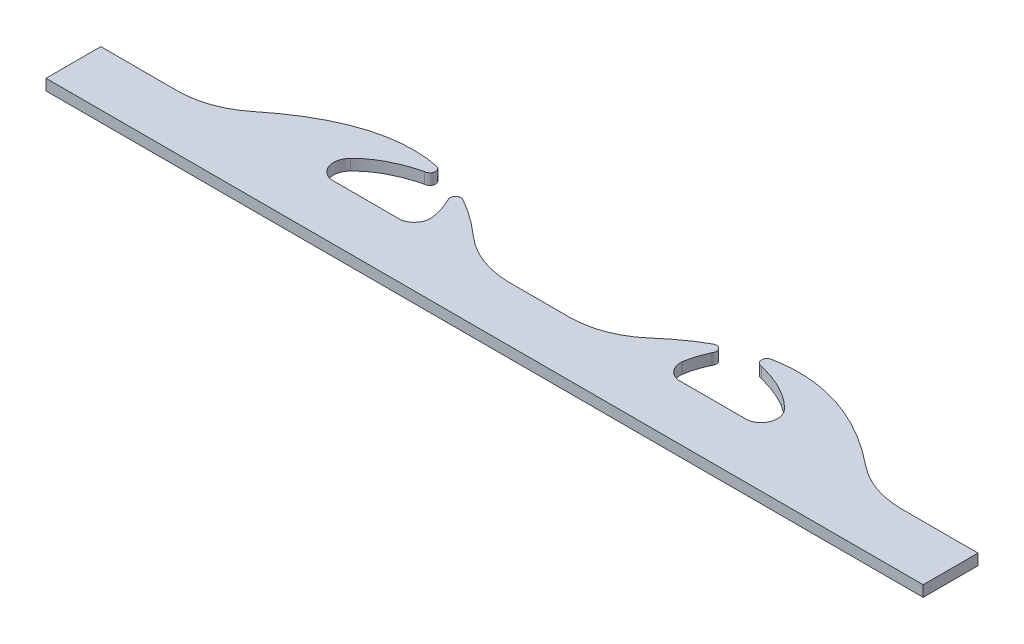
ISO-10303-21;
HEADER;
FILE_DESCRIPTION(('STEP AP214'),'2;1');
FILE_NAME('part.step','',(''),(''),'','','');
FILE_SCHEMA(('AUTOMOTIVE_DESIGN { 1 0 10303 214 1 1 1 1 }'));
ENDSEC;
DATA;
#1=APPLICATION_CONTEXT('core data for automotive mechanical design processes');
#2=APPLICATION_PROTOCOL_DEFINITION('international standard','automotive_design',2000,#1);
#3=PRODUCT_CONTEXT('',#1,'mechanical');
#4=PRODUCT('Part','Part','',(#3));
#5=PRODUCT_RELATED_PRODUCT_CATEGORY('part','',(#4));
#6=PRODUCT_DEFINITION_FORMATION('','',#4);
#7=PRODUCT_DEFINITION_CONTEXT('part definition',#1,'design');
#8=PRODUCT_DEFINITION('design','',#6,#7);
#9=PRODUCT_DEFINITION_SHAPE('','',#8);
#10=(LENGTH_UNIT() NAMED_UNIT(*) SI_UNIT(.MILLI.,.METRE.));
#11=(NAMED_UNIT(*) PLANE_ANGLE_UNIT() SI_UNIT($,.RADIAN.));
#12=(NAMED_UNIT(*) SI_UNIT($,.STERADIAN.) SOLID_ANGLE_UNIT());
#13=UNCERTAINTY_MEASURE_WITH_UNIT(LENGTH_MEASURE(1.E-05),#10,'distance_accuracy_value','');
#14=(GEOMETRIC_REPRESENTATION_CONTEXT(3) GLOBAL_UNCERTAINTY_ASSIGNED_CONTEXT((#13)) GLOBAL_UNIT_ASSIGNED_CONTEXT((#10,
#11,#12)) REPRESENTATION_CONTEXT('',''));
#15=CARTESIAN_POINT('',(0.,0.,0.));
#16=DIRECTION('',(0.,0.,1.));
#17=DIRECTION('',(1.,0.,0.));
#18=AXIS2_PLACEMENT_3D('',#15,#16,#17);
#19=CARTESIAN_POINT('',(33.011381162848,1.,-13.));
#20=DIRECTION('',(0.,-1.,0.));
#21=DIRECTION('',(0.,0.,-1.));
#22=AXIS2_PLACEMENT_3D('',#19,#20,#21);
#23=CYLINDRICAL_SURFACE('',#22,8.);
#24=CARTESIAN_POINT('',(33.011381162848,0.,-13.));
#25=DIRECTION('',(0.,-1.,0.));
#26=DIRECTION('',(0.,0.,-1.));
#27=AXIS2_PLACEMENT_3D('',#24,#25,#26);
#28=CIRCLE('',#27,8.);
#29=CARTESIAN_POINT('',(33.011381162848,0.,-5.));
#30=VERTEX_POINT('',#29);
#31=CARTESIAN_POINT('',(27.9776129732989,0.,-6.78218866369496));
#32=VERTEX_POINT('',#31);
#33=EDGE_CURVE('E249',#30,#32,#28,.T.);
#34=ORIENTED_EDGE('',*,*,#33,.T.);
#35=DIRECTION('',(0.,-1.,0.));
#36=VECTOR('',#35,1.);
#37=CARTESIAN_POINT('',(27.9776129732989,1.,-6.78218866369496));
#38=LINE('',#37,#36);
#39=CARTESIAN_POINT('',(27.9776129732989,1.,-6.78218866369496));
#40=VERTEX_POINT('',#39);
#41=EDGE_CURVE('E11',#40,#32,#38,.T.);
#42=ORIENTED_EDGE('',*,*,#41,.F.);
#43=CARTESIAN_POINT('',(33.011381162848,1.,-13.));
#44=DIRECTION('',(0.,-1.,0.));
#45=DIRECTION('',(0.,0.,-1.));
#46=AXIS2_PLACEMENT_3D('',#43,#44,#45);
#47=CIRCLE('',#46,8.);
#48=CARTESIAN_POINT('',(33.011381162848,1.,-5.));
#49=VERTEX_POINT('',#48);
#50=EDGE_CURVE('E343',#49,#40,#47,.T.);
#51=ORIENTED_EDGE('',*,*,#50,.F.);
#52=DIRECTION('',(0.,-1.,0.));
#53=VECTOR('',#52,1.);
#54=CARTESIAN_POINT('',(33.011381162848,1.,-5.));
#55=LINE('',#54,#53);
#56=EDGE_CURVE('E245',#49,#30,#55,.T.);
#57=ORIENTED_EDGE('',*,*,#56,.T.);
#58=EDGE_LOOP('',(#34,#42,#51,#57));
#59=FACE_BOUND('',#58,.T.);
#60=ADVANCED_FACE('F33',(#59),#23,.F.);
#61=CARTESIAN_POINT('',(27.9776129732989,1.,-6.78218866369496));
#62=CARTESIAN_POINT('',(23.8539215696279,1.,-10.120615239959));
#63=CARTESIAN_POINT('',(19.5835212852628,1.,-11.6243992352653));
#64=CARTESIAN_POINT('',(15.4631654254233,1.,-10.9173485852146));
#65=CARTESIAN_POINT('',(15.1957010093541,1.,-10.8619827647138));
#66=B_SPLINE_CURVE_WITH_KNOTS('',3,(#61,#62,#63,#64,#65),.UNSPECIFIED.,.F.,.F.,(4,1,4),
(0.0792264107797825,0.566366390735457,0.600269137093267),.UNSPECIFIED.);
#67=DIRECTION('',(0.,-1.,0.));
#68=VECTOR('',#67,1.);
#69=SURFACE_OF_LINEAR_EXTRUSION('',#66,#68);
#70=CARTESIAN_POINT('',(27.9776129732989,0.,-6.78218866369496));
#71=CARTESIAN_POINT('',(23.8539215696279,0.,-10.120615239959));
#72=CARTESIAN_POINT('',(19.5835212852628,0.,-11.6243992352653));
#73=CARTESIAN_POINT('',(15.4631654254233,0.,-10.9173485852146));
#74=CARTESIAN_POINT('',(15.1957010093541,0.,-10.8619827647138));
#75=B_SPLINE_CURVE_WITH_KNOTS('',3,(#70,#71,#72,#73,#74),.UNSPECIFIED.,.F.,.F.,(4,1,4),
(0.0792264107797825,0.566366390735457,0.600269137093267),.UNSPECIFIED.);
#76=CARTESIAN_POINT('',(15.1957010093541,0.,-10.8619827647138));
#77=VERTEX_POINT('',#76);
#78=EDGE_CURVE('E252',#32,#77,#75,.T.);
#79=ORIENTED_EDGE('',*,*,#78,.T.);
#80=DIRECTION('',(0.,-1.,0.));
#81=VECTOR('',#80,1.);
#82=CARTESIAN_POINT('',(15.1957010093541,1.,-10.8619827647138));
#83=LINE('',#82,#81);
#84=CARTESIAN_POINT('',(15.1957010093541,1.,-10.8619827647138));
#85=VERTEX_POINT('',#84);
#86=EDGE_CURVE('E41',#85,#77,#83,.T.);
#87=ORIENTED_EDGE('',*,*,#86,.F.);
#88=EDGE_CURVE('E152',#40,#85,#66,.T.);
#89=ORIENTED_EDGE('',*,*,#88,.F.);
#90=ORIENTED_EDGE('',*,*,#41,.T.);
#91=EDGE_LOOP('',(#79,#87,#89,#90));
#92=FACE_BOUND('',#91,.T.);
#93=ADVANCED_FACE('F478',(#92),#69,.F.);
#94=CARTESIAN_POINT('',(15.3715812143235,1.,-10.3939377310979));
#95=DIRECTION('',(0.,-1.,0.));
#96=DIRECTION('',(0.,0.,-1.));
#97=AXIS2_PLACEMENT_3D('',#94,#95,#96);
#98=CYLINDRICAL_SURFACE('',#97,0.499999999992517);
#99=CARTESIAN_POINT('',(15.3715812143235,0.,-10.3939377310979));
#100=DIRECTION('',(0.,1.,0.));
#101=DIRECTION('',(0.,0.,1.));
#102=AXIS2_PLACEMENT_3D('',#99,#100,#101);
#103=CIRCLE('',#102,0.499999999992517);
#104=CARTESIAN_POINT('',(15.3715812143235,0.,-9.89393773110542));
#105=VERTEX_POINT('',#104);
#106=EDGE_CURVE('E256',#77,#105,#103,.T.);
#107=ORIENTED_EDGE('',*,*,#106,.T.);
#108=DIRECTION('',(0.,-1.,0.));
#109=VECTOR('',#108,1.);
#110=CARTESIAN_POINT('',(15.3715812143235,1.,-9.89393773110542));
#111=LINE('',#110,#109);
#112=CARTESIAN_POINT('',(15.3715812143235,1.,-9.89393773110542));
#113=VERTEX_POINT('',#112);
#114=EDGE_CURVE('E410',#113,#105,#111,.T.);
#115=ORIENTED_EDGE('',*,*,#114,.F.);
#116=CARTESIAN_POINT('',(15.3715812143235,1.,-10.3939377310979));
#117=DIRECTION('',(0.,1.,0.));
#118=DIRECTION('',(0.,0.,1.));
#119=AXIS2_PLACEMENT_3D('',#116,#117,#118);
#120=CIRCLE('',#119,0.499999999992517);
#121=EDGE_CURVE('E418',#85,#113,#120,.T.);
#122=ORIENTED_EDGE('',*,*,#121,.F.);
#123=ORIENTED_EDGE('',*,*,#86,.T.);
#124=EDGE_LOOP('',(#107,#115,#122,#123));
#125=FACE_BOUND('',#124,.T.);
#126=ADVANCED_FACE('F416',(#125),#98,.T.);
#127=CARTESIAN_POINT('',(15.3715812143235,1.,-9.89393773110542));
#128=CARTESIAN_POINT('',(18.3559813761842,1.,-9.14469898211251));
#129=CARTESIAN_POINT('',(19.5334496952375,1.,-7.80716702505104));
#130=CARTESIAN_POINT('',(19.7970427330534,1.,-7.5456796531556));
#131=B_SPLINE_CURVE_WITH_KNOTS('',3,(#127,#128,#129,#130),.UNSPECIFIED.,.F.,.F.,(4,4),(0.,1.),.UNSPECIFIED.);
#132=DIRECTION('',(0.,-1.,0.));
#133=VECTOR('',#132,1.);
#134=SURFACE_OF_LINEAR_EXTRUSION('',#131,#133);
#135=CARTESIAN_POINT('',(15.3715812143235,0.,-9.89393773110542));
#136=CARTESIAN_POINT('',(18.3559813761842,0.,-9.14469898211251));
#137=CARTESIAN_POINT('',(19.5334496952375,0.,-7.80716702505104));
#138=CARTESIAN_POINT('',(19.7970427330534,0.,-7.5456796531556));
#139=B_SPLINE_CURVE_WITH_KNOTS('',3,(#135,#136,#137,#138),.UNSPECIFIED.,.F.,.F.,(4,4),(0.,1.),.UNSPECIFIED.);
#140=CARTESIAN_POINT('',(19.7970427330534,0.,-7.5456796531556));
#141=VERTEX_POINT('',#140);
#142=EDGE_CURVE('E261',#105,#141,#139,.T.);
#143=ORIENTED_EDGE('',*,*,#142,.T.);
#144=DIRECTION('',(0.,-1.,0.));
#145=VECTOR('',#144,1.);
#146=CARTESIAN_POINT('',(19.7970427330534,1.,-7.5456796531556));
#147=LINE('',#146,#145);
#148=CARTESIAN_POINT('',(19.7970427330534,1.,-7.5456796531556));
#149=VERTEX_POINT('',#148);
#150=EDGE_CURVE('E407',#149,#141,#147,.T.);
#151=ORIENTED_EDGE('',*,*,#150,.F.);
#152=EDGE_CURVE('E436',#113,#149,#131,.T.);
#153=ORIENTED_EDGE('',*,*,#152,.F.);
#154=ORIENTED_EDGE('',*,*,#114,.T.);
#155=EDGE_LOOP('',(#143,#151,#153,#154));
#156=FACE_BOUND('',#155,.T.);
#157=ADVANCED_FACE('F427',(#156),#134,.F.);
#158=CARTESIAN_POINT('',(18.7453083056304,1.,-6.47616822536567));
#159=DIRECTION('',(0.,-1.,0.));
#160=DIRECTION('',(0.,0.,-1.));
#161=AXIS2_PLACEMENT_3D('',#158,#159,#160);
#162=CYLINDRICAL_SURFACE('',#161,1.5);
#163=CARTESIAN_POINT('',(18.7453083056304,0.,-6.47616822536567));
#164=DIRECTION('',(0.,-1.,0.));
#165=DIRECTION('',(0.,0.,1.));
#166=AXIS2_PLACEMENT_3D('',#163,#164,#165);
#167=CIRCLE('',#166,1.5);
#168=CARTESIAN_POINT('',(19.0116302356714,0.,-5.));
#169=VERTEX_POINT('',#168);
#170=EDGE_CURVE('E265',#141,#169,#167,.T.);
#171=ORIENTED_EDGE('',*,*,#170,.T.);
#172=DIRECTION('',(0.,-1.,0.));
#173=VECTOR('',#172,1.);
#174=CARTESIAN_POINT('',(19.0116302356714,1.,-5.));
#175=LINE('',#174,#173);
#176=CARTESIAN_POINT('',(19.0116302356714,1.,-5.));
#177=VERTEX_POINT('',#176);
#178=EDGE_CURVE('E404',#177,#169,#175,.T.);
#179=ORIENTED_EDGE('',*,*,#178,.F.);
#180=CARTESIAN_POINT('',(18.7453083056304,1.,-6.47616822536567));
#181=DIRECTION('',(0.,-1.,0.));
#182=DIRECTION('',(0.,0.,1.));
#183=AXIS2_PLACEMENT_3D('',#180,#181,#182);
#184=CIRCLE('',#183,1.5);
#185=EDGE_CURVE('E433',#149,#177,#184,.T.);
#186=ORIENTED_EDGE('',*,*,#185,.F.);
#187=ORIENTED_EDGE('',*,*,#150,.T.);
#188=EDGE_LOOP('',(#171,#179,#186,#187));
#189=FACE_BOUND('',#188,.T.);
#190=ADVANCED_FACE('F431',(#189),#162,.F.);
#191=CARTESIAN_POINT('',(12.6254232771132,1.,-5.));
#192=DIRECTION('',(0.,0.,1.));
#193=DIRECTION('',(1.,0.,0.));
#194=AXIS2_PLACEMENT_3D('',#191,#192,#193);
#195=PLANE('',#194);
#196=DIRECTION('',(-1.,0.,0.));
#197=VECTOR('',#196,1.);
#198=CARTESIAN_POINT('',(12.6254232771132,0.,-5.));
#199=LINE('',#198,#197);
#200=CARTESIAN_POINT('',(12.6254232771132,0.,-5.));
#201=VERTEX_POINT('',#200);
#202=EDGE_CURVE('E270',#169,#201,#199,.T.);
#203=ORIENTED_EDGE('',*,*,#202,.T.);
#204=DIRECTION('',(0.,-1.,0.));
#205=VECTOR('',#204,1.);
#206=CARTESIAN_POINT('',(12.6254232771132,1.,-5.));
#207=LINE('',#206,#205);
#208=CARTESIAN_POINT('',(12.6254232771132,1.,-5.));
#209=VERTEX_POINT('',#208);
#210=EDGE_CURVE('E401',#209,#201,#207,.T.);
#211=ORIENTED_EDGE('',*,*,#210,.F.);
#212=DIRECTION('',(-1.,0.,0.));
#213=VECTOR('',#212,1.);
#214=CARTESIAN_POINT('',(12.6254232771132,1.,-5.));
#215=LINE('',#214,#213);
#216=EDGE_CURVE('E435',#177,#209,#215,.T.);
#217=ORIENTED_EDGE('',*,*,#216,.F.);
#218=ORIENTED_EDGE('',*,*,#178,.T.);
#219=EDGE_LOOP('',(#203,#211,#217,#218));
#220=FACE_BOUND('',#219,.T.);
#221=ADVANCED_FACE('F468',(#220),#195,.F.);
#222=CARTESIAN_POINT('',(12.8917452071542,1.,-6.47616822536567));
#223=DIRECTION('',(0.,-1.,0.));
#224=DIRECTION('',(0.,0.,-1.));
#225=AXIS2_PLACEMENT_3D('',#222,#223,#224);
#226=CYLINDRICAL_SURFACE('',#225,1.5);
#227=CARTESIAN_POINT('',(12.8917452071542,0.,-6.47616822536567));
#228=DIRECTION('',(0.,-1.,0.));
#229=DIRECTION('',(0.,0.,1.));
#230=AXIS2_PLACEMENT_3D('',#227,#228,#229);
#231=CIRCLE('',#230,1.5);
#232=CARTESIAN_POINT('',(11.3978589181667,0.,-6.61145959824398));
#233=VERTEX_POINT('',#232);
#234=EDGE_CURVE('E272',#201,#233,#231,.T.);
#235=ORIENTED_EDGE('',*,*,#234,.T.);
#236=DIRECTION('',(0.,-1.,0.));
#237=VECTOR('',#236,1.);
#238=CARTESIAN_POINT('',(11.3978589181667,1.,-6.61145959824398));
#239=LINE('',#238,#237);
#240=CARTESIAN_POINT('',(11.3978589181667,1.,-6.61145959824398));
#241=VERTEX_POINT('',#240);
#242=EDGE_CURVE('E398',#241,#233,#239,.T.);
#243=ORIENTED_EDGE('',*,*,#242,.F.);
#244=CARTESIAN_POINT('',(12.8917452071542,1.,-6.47616822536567));
#245=DIRECTION('',(0.,-1.,0.));
#246=DIRECTION('',(0.,0.,1.));
#247=AXIS2_PLACEMENT_3D('',#244,#245,#246);
#248=CIRCLE('',#247,1.5);
#249=EDGE_CURVE('E438',#209,#241,#248,.T.);
#250=ORIENTED_EDGE('',*,*,#249,.F.);
#251=ORIENTED_EDGE('',*,*,#210,.T.);
#252=EDGE_LOOP('',(#235,#243,#250,#251));
#253=FACE_BOUND('',#252,.T.);
#254=ADVANCED_FACE('F463',(#253),#226,.F.);
#255=CARTESIAN_POINT('',(11.3978589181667,1.,-6.61145959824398));
#256=CARTESIAN_POINT('',(11.5099300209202,1.,-7.51159308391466));
#257=CARTESIAN_POINT('',(12.0355670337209,1.,-8.68251660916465));
#258=B_SPLINE_CURVE_WITH_KNOTS('',2,(#255,#256,#257),.UNSPECIFIED.,.F.,.F.,(3,3),(0.,1.),.UNSPECIFIED.);
#259=DIRECTION('',(0.,-1.,0.));
#260=VECTOR('',#259,1.);
#261=SURFACE_OF_LINEAR_EXTRUSION('',#258,#260);
#262=CARTESIAN_POINT('',(11.3978589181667,0.,-6.61145959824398));
#263=CARTESIAN_POINT('',(11.5099300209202,0.,-7.51159308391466));
#264=CARTESIAN_POINT('',(12.0355670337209,0.,-8.68251660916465));
#265=B_SPLINE_CURVE_WITH_KNOTS('',2,(#262,#263,#264),.UNSPECIFIED.,.F.,.F.,(3,3),(0.,1.),.UNSPECIFIED.);
#266=CARTESIAN_POINT('',(12.0355670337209,0.,-8.68251660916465));
#267=VERTEX_POINT('',#266);
#268=EDGE_CURVE('E274',#233,#267,#265,.T.);
#269=ORIENTED_EDGE('',*,*,#268,.T.);
#270=DIRECTION('',(0.,-1.,0.));
#271=VECTOR('',#270,1.);
#272=CARTESIAN_POINT('',(12.0355670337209,1.,-8.68251660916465));
#273=LINE('',#272,#271);
#274=CARTESIAN_POINT('',(12.0355670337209,1.,-8.68251660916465));
#275=VERTEX_POINT('',#274);
#276=EDGE_CURVE('E395',#275,#267,#273,.T.);
#277=ORIENTED_EDGE('',*,*,#276,.F.);
#278=EDGE_CURVE('E447',#241,#275,#258,.T.);
#279=ORIENTED_EDGE('',*,*,#278,.F.);
#280=ORIENTED_EDGE('',*,*,#242,.T.);
#281=EDGE_LOOP('',(#269,#277,#279,#280));
#282=FACE_BOUND('',#281,.T.);
#283=ADVANCED_FACE('F458',(#282),#261,.F.);
#284=CARTESIAN_POINT('',(11.6440581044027,1.,-8.99351622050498));
#285=DIRECTION('',(0.,-1.,0.));
#286=DIRECTION('',(0.,0.,-1.));
#287=AXIS2_PLACEMENT_3D('',#284,#285,#286);
#288=CYLINDRICAL_SURFACE('',#287,0.499999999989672);
#289=CARTESIAN_POINT('',(11.6440581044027,0.,-8.99351622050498));
#290=DIRECTION('',(0.,1.,0.));
#291=DIRECTION('',(0.,0.,1.));
#292=AXIS2_PLACEMENT_3D('',#289,#290,#291);
#293=CIRCLE('',#292,0.499999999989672);
#294=CARTESIAN_POINT('',(11.4660383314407,0.,-9.46075166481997));
#295=VERTEX_POINT('',#294);
#296=EDGE_CURVE('E278',#267,#295,#293,.T.);
#297=ORIENTED_EDGE('',*,*,#296,.T.);
#298=DIRECTION('',(0.,-1.,0.));
#299=VECTOR('',#298,1.);
#300=CARTESIAN_POINT('',(11.4660383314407,1.,-9.46075166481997));
#301=LINE('',#300,#299);
#302=CARTESIAN_POINT('',(11.4660383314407,1.,-9.46075166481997));
#303=VERTEX_POINT('',#302);
#304=EDGE_CURVE('E392',#303,#295,#301,.T.);
#305=ORIENTED_EDGE('',*,*,#304,.F.);
#306=CARTESIAN_POINT('',(11.6440581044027,1.,-8.99351622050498));
#307=DIRECTION('',(0.,1.,0.));
#308=DIRECTION('',(0.,0.,1.));
#309=AXIS2_PLACEMENT_3D('',#306,#307,#308);
#310=CIRCLE('',#309,0.499999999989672);
#311=EDGE_CURVE('E452',#275,#303,#310,.T.);
#312=ORIENTED_EDGE('',*,*,#311,.F.);
#313=ORIENTED_EDGE('',*,*,#276,.T.);
#314=EDGE_LOOP('',(#297,#305,#312,#313));
#315=FACE_BOUND('',#314,.T.);
#316=ADVANCED_FACE('F462',(#315),#288,.T.);
#317=CARTESIAN_POINT('',(11.4660383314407,1.,-9.46075166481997));
#318=CARTESIAN_POINT('',(10.8872755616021,1.,-9.14344581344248));
#319=CARTESIAN_POINT('',(9.73597383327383,1.,-8.41712914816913));
#320=CARTESIAN_POINT('',(8.59711972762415,1.,-7.50740255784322));
#321=CARTESIAN_POINT('',(8.0308045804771,1.,-7.00668678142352));
#322=B_SPLINE_CURVE_WITH_KNOTS('',3,(#317,#318,#319,#320,#321),.UNSPECIFIED.,.F.,.F.,(4,1,4),
(0.759634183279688,0.834671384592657,0.909708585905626),.UNSPECIFIED.);
#323=DIRECTION('',(0.,-1.,0.));
#324=VECTOR('',#323,1.);
#325=SURFACE_OF_LINEAR_EXTRUSION('',#322,#324);
#326=CARTESIAN_POINT('',(11.4660383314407,0.,-9.46075166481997));
#327=CARTESIAN_POINT('',(10.8872755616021,0.,-9.14344581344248));
#328=CARTESIAN_POINT('',(9.73597383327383,0.,-8.41712914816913));
#329=CARTESIAN_POINT('',(8.59711972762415,0.,-7.50740255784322));
#330=CARTESIAN_POINT('',(8.0308045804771,0.,-7.00668678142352));
#331=B_SPLINE_CURVE_WITH_KNOTS('',3,(#326,#327,#328,#329,#330),.UNSPECIFIED.,.F.,.F.,(4,1,4),
(0.759634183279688,0.834671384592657,0.909708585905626),.UNSPECIFIED.);
#332=CARTESIAN_POINT('',(8.0308045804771,0.,-7.00668678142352));
#333=VERTEX_POINT('',#332);
#334=EDGE_CURVE('E283',#295,#333,#331,.T.);
#335=ORIENTED_EDGE('',*,*,#334,.T.);
#336=DIRECTION('',(0.,-1.,0.));
#337=VECTOR('',#336,1.);
#338=CARTESIAN_POINT('',(8.0308045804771,1.,-7.00668678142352));
#339=LINE('',#338,#337);
#340=CARTESIAN_POINT('',(8.0308045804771,1.,-7.00668678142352));
#341=VERTEX_POINT('',#340);
#342=EDGE_CURVE('E389',#341,#333,#339,.T.);
#343=ORIENTED_EDGE('',*,*,#342,.F.);
#344=EDGE_CURVE('E586',#303,#341,#322,.T.);
#345=ORIENTED_EDGE('',*,*,#344,.F.);
#346=ORIENTED_EDGE('',*,*,#304,.T.);
#347=EDGE_LOOP('',(#335,#343,#345,#346));
#348=FACE_BOUND('',#347,.T.);
#349=ADVANCED_FACE('F583',(#348),#325,.F.);
#350=CARTESIAN_POINT('',(2.73172950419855,1.,-13.));
#351=DIRECTION('',(0.,-1.,0.));
#352=DIRECTION('',(0.,0.,-1.));
#353=AXIS2_PLACEMENT_3D('',#350,#351,#352);
#354=CYLINDRICAL_SURFACE('',#353,8.);
#355=CARTESIAN_POINT('',(2.73172950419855,0.,-13.));
#356=DIRECTION('',(0.,-1.,0.));
#357=DIRECTION('',(0.,0.,-1.));
#358=AXIS2_PLACEMENT_3D('',#355,#356,#357);
#359=CIRCLE('',#358,8.);
#360=CARTESIAN_POINT('',(2.73172950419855,0.,-5.));
#361=VERTEX_POINT('',#360);
#362=EDGE_CURVE('E287',#333,#361,#359,.T.);
#363=ORIENTED_EDGE('',*,*,#362,.T.);
#364=DIRECTION('',(0.,-1.,0.));
#365=VECTOR('',#364,1.);
#366=CARTESIAN_POINT('',(2.73172950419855,1.,-5.));
#367=LINE('',#366,#365);
#368=CARTESIAN_POINT('',(2.73172950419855,1.,-5.));
#369=VERTEX_POINT('',#368);
#370=EDGE_CURVE('E386',#369,#361,#367,.T.);
#371=ORIENTED_EDGE('',*,*,#370,.F.);
#372=CARTESIAN_POINT('',(2.73172950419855,1.,-13.));
#373=DIRECTION('',(0.,-1.,0.));
#374=DIRECTION('',(0.,0.,-1.));
#375=AXIS2_PLACEMENT_3D('',#372,#373,#374);
#376=CIRCLE('',#375,8.);
#377=EDGE_CURVE('E577',#341,#369,#376,.T.);
#378=ORIENTED_EDGE('',*,*,#377,.F.);
#379=ORIENTED_EDGE('',*,*,#342,.T.);
#380=EDGE_LOOP('',(#363,#371,#378,#379));
#381=FACE_BOUND('',#380,.T.);
#382=ADVANCED_FACE('F576',(#381),#354,.F.);
#383=CARTESIAN_POINT('',(2.73172950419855,1.,-5.));
#384=DIRECTION('',(0.,0.,1.));
#385=DIRECTION('',(1.,0.,0.));
#386=AXIS2_PLACEMENT_3D('',#383,#384,#385);
#387=PLANE('',#386);
#388=DIRECTION('',(-1.,0.,0.));
#389=VECTOR('',#388,1.);
#390=CARTESIAN_POINT('',(2.73172950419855,0.,-5.));
#391=LINE('',#390,#389);
#392=CARTESIAN_POINT('',(-2.73172950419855,0.,-5.00000000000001));
#393=VERTEX_POINT('',#392);
#394=EDGE_CURVE('E292',#361,#393,#391,.T.);
#395=ORIENTED_EDGE('',*,*,#394,.T.);
#396=DIRECTION('',(0.,-1.,0.));
#397=VECTOR('',#396,1.);
#398=CARTESIAN_POINT('',(-2.73172950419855,1.,-5.00000000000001));
#399=LINE('',#398,#397);
#400=CARTESIAN_POINT('',(-2.73172950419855,1.,-5.00000000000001));
#401=VERTEX_POINT('',#400);
#402=EDGE_CURVE('E383',#401,#393,#399,.T.);
#403=ORIENTED_EDGE('',*,*,#402,.F.);
#404=DIRECTION('',(-1.,0.,0.));
#405=VECTOR('',#404,1.);
#406=CARTESIAN_POINT('',(2.73172950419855,1.,-5.));
#407=LINE('',#406,#405);
#408=EDGE_CURVE('E572',#369,#401,#407,.T.);
#409=ORIENTED_EDGE('',*,*,#408,.F.);
#410=ORIENTED_EDGE('',*,*,#370,.T.);
#411=EDGE_LOOP('',(#395,#403,#409,#410));
#412=FACE_BOUND('',#411,.T.);
#413=ADVANCED_FACE('F571',(#412),#387,.F.);
#414=CARTESIAN_POINT('',(-2.73172950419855,1.,-13.));
#415=DIRECTION('',(0.,-1.,0.));
#416=DIRECTION('',(0.,0.,-1.));
#417=AXIS2_PLACEMENT_3D('',#414,#415,#416);
#418=CYLINDRICAL_SURFACE('',#417,8.);
#419=CARTESIAN_POINT('',(-2.73172950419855,0.,-13.));
#420=DIRECTION('',(0.,-1.,0.));
#421=DIRECTION('',(0.,0.,1.));
#422=AXIS2_PLACEMENT_3D('',#419,#420,#421);
#423=CIRCLE('',#422,8.);
#424=CARTESIAN_POINT('',(-8.0308045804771,0.,-7.00668678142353));
#425=VERTEX_POINT('',#424);
#426=EDGE_CURVE('E294',#393,#425,#423,.T.);
#427=ORIENTED_EDGE('',*,*,#426,.T.);
#428=DIRECTION('',(0.,-1.,0.));
#429=VECTOR('',#428,1.);
#430=CARTESIAN_POINT('',(-8.0308045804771,1.,-7.00668678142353));
#431=LINE('',#430,#429);
#432=CARTESIAN_POINT('',(-8.0308045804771,1.,-7.00668678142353));
#433=VERTEX_POINT('',#432);
#434=EDGE_CURVE('E380',#433,#425,#431,.T.);
#435=ORIENTED_EDGE('',*,*,#434,.F.);
#436=CARTESIAN_POINT('',(-2.73172950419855,1.,-13.));
#437=DIRECTION('',(0.,-1.,0.));
#438=DIRECTION('',(0.,0.,1.));
#439=AXIS2_PLACEMENT_3D('',#436,#437,#438);
#440=CIRCLE('',#439,8.);
#441=EDGE_CURVE('E568',#401,#433,#440,.T.);
#442=ORIENTED_EDGE('',*,*,#441,.F.);
#443=ORIENTED_EDGE('',*,*,#402,.T.);
#444=EDGE_LOOP('',(#427,#435,#442,#443));
#445=FACE_BOUND('',#444,.T.);
#446=ADVANCED_FACE('F565',(#445),#418,.F.);
#447=CARTESIAN_POINT('',(-8.0308045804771,1.,-7.00668678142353));
#448=CARTESIAN_POINT('',(-8.59711972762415,1.,-7.50740255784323));
#449=CARTESIAN_POINT('',(-9.73597383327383,1.,-8.41712914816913));
#450=CARTESIAN_POINT('',(-10.8872755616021,1.,-9.14344581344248));
#451=CARTESIAN_POINT('',(-11.4660383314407,1.,-9.46075166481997));
#452=B_SPLINE_CURVE_WITH_KNOTS('',3,(#447,#448,#449,#450,#451),.UNSPECIFIED.,.F.,.F.,(4,1,4),
(0.759634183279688,0.834671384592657,0.909708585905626),.UNSPECIFIED.);
#453=DIRECTION('',(0.,-1.,0.));
#454=VECTOR('',#453,1.);
#455=SURFACE_OF_LINEAR_EXTRUSION('',#452,#454);
#456=CARTESIAN_POINT('',(-8.0308045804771,0.,-7.00668678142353));
#457=CARTESIAN_POINT('',(-8.59711972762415,0.,-7.50740255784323));
#458=CARTESIAN_POINT('',(-9.73597383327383,0.,-8.41712914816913));
#459=CARTESIAN_POINT('',(-10.8872755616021,0.,-9.14344581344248));
#460=CARTESIAN_POINT('',(-11.4660383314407,0.,-9.46075166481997));
#461=B_SPLINE_CURVE_WITH_KNOTS('',3,(#456,#457,#458,#459,#460),.UNSPECIFIED.,.F.,.F.,(4,1,4),
(0.759634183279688,0.834671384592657,0.909708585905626),.UNSPECIFIED.);
#462=CARTESIAN_POINT('',(-11.4660383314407,0.,-9.46075166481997));
#463=VERTEX_POINT('',#462);
#464=EDGE_CURVE('E296',#425,#463,#461,.T.);
#465=ORIENTED_EDGE('',*,*,#464,.T.);
#466=DIRECTION('',(0.,-1.,0.));
#467=VECTOR('',#466,1.);
#468=CARTESIAN_POINT('',(-11.4660383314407,1.,-9.46075166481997));
#469=LINE('',#468,#467);
#470=CARTESIAN_POINT('',(-11.4660383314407,1.,-9.46075166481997));
#471=VERTEX_POINT('',#470);
#472=EDGE_CURVE('E377',#471,#463,#469,.T.);
#473=ORIENTED_EDGE('',*,*,#472,.F.);
#474=EDGE_CURVE('E559',#433,#471,#452,.T.);
#475=ORIENTED_EDGE('',*,*,#474,.F.);
#476=ORIENTED_EDGE('',*,*,#434,.T.);
#477=EDGE_LOOP('',(#465,#473,#475,#476));
#478=FACE_BOUND('',#477,.T.);
#479=ADVANCED_FACE('F558',(#478),#455,.F.);
#480=CARTESIAN_POINT('',(-11.6440581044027,1.,-8.99351622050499));
#481=DIRECTION('',(0.,-1.,0.));
#482=DIRECTION('',(0.,0.,-1.));
#483=AXIS2_PLACEMENT_3D('',#480,#481,#482);
#484=CYLINDRICAL_SURFACE('',#483,0.499999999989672);
#485=CARTESIAN_POINT('',(-11.6440581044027,0.,-8.99351622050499));
#486=DIRECTION('',(0.,1.,0.));
#487=DIRECTION('',(0.,0.,-1.));
#488=AXIS2_PLACEMENT_3D('',#485,#486,#487);
#489=CIRCLE('',#488,0.499999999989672);
#490=CARTESIAN_POINT('',(-12.0355670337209,0.,-8.68251660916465));
#491=VERTEX_POINT('',#490);
#492=EDGE_CURVE('E300',#463,#491,#489,.T.);
#493=ORIENTED_EDGE('',*,*,#492,.T.);
#494=DIRECTION('',(0.,-1.,0.));
#495=VECTOR('',#494,1.);
#496=CARTESIAN_POINT('',(-12.0355670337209,1.,-8.68251660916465));
#497=LINE('',#496,#495);
#498=CARTESIAN_POINT('',(-12.0355670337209,1.,-8.68251660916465));
#499=VERTEX_POINT('',#498);
#500=EDGE_CURVE('E374',#499,#491,#497,.T.);
#501=ORIENTED_EDGE('',*,*,#500,.F.);
#502=CARTESIAN_POINT('',(-11.6440581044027,1.,-8.99351622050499));
#503=DIRECTION('',(0.,1.,0.));
#504=DIRECTION('',(0.,0.,-1.));
#505=AXIS2_PLACEMENT_3D('',#502,#503,#504);
#506=CIRCLE('',#505,0.499999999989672);
#507=EDGE_CURVE('E554',#471,#499,#506,.T.);
#508=ORIENTED_EDGE('',*,*,#507,.F.);
#509=ORIENTED_EDGE('',*,*,#472,.T.);
#510=EDGE_LOOP('',(#493,#501,#508,#509));
#511=FACE_BOUND('',#510,.T.);
#512=ADVANCED_FACE('F553',(#511),#484,.T.);
#513=CARTESIAN_POINT('',(-12.0355670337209,1.,-8.68251660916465));
#514=CARTESIAN_POINT('',(-11.5099300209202,1.,-7.51159308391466));
#515=CARTESIAN_POINT('',(-11.3978589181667,1.,-6.61145959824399));
#516=B_SPLINE_CURVE_WITH_KNOTS('',2,(#513,#514,#515),.UNSPECIFIED.,.F.,.F.,(3,3),(0.,1.),.UNSPECIFIED.);
#517=DIRECTION('',(0.,-1.,0.));
#518=VECTOR('',#517,1.);
#519=SURFACE_OF_LINEAR_EXTRUSION('',#516,#518);
#520=CARTESIAN_POINT('',(-12.0355670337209,0.,-8.68251660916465));
#521=CARTESIAN_POINT('',(-11.5099300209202,0.,-7.51159308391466));
#522=CARTESIAN_POINT('',(-11.3978589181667,0.,-6.61145959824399));
#523=B_SPLINE_CURVE_WITH_KNOTS('',2,(#520,#521,#522),.UNSPECIFIED.,.F.,.F.,(3,3),(0.,1.),.UNSPECIFIED.);
#524=CARTESIAN_POINT('',(-11.3978589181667,0.,-6.61145959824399));
#525=VERTEX_POINT('',#524);
#526=EDGE_CURVE('E305',#491,#525,#523,.T.);
#527=ORIENTED_EDGE('',*,*,#526,.T.);
#528=DIRECTION('',(0.,-1.,0.));
#529=VECTOR('',#528,1.);
#530=CARTESIAN_POINT('',(-11.3978589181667,1.,-6.61145959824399));
#531=LINE('',#530,#529);
#532=CARTESIAN_POINT('',(-11.3978589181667,1.,-6.61145959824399));
#533=VERTEX_POINT('',#532);
#534=EDGE_CURVE('E371',#533,#525,#531,.T.);
#535=ORIENTED_EDGE('',*,*,#534,.F.);
#536=EDGE_CURVE('E550',#499,#533,#516,.T.);
#537=ORIENTED_EDGE('',*,*,#536,.F.);
#538=ORIENTED_EDGE('',*,*,#500,.T.);
#539=EDGE_LOOP('',(#527,#535,#537,#538));
#540=FACE_BOUND('',#539,.T.);
#541=ADVANCED_FACE('F547',(#540),#519,.F.);
#542=CARTESIAN_POINT('',(-12.8917452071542,1.,-6.47616822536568));
#543=DIRECTION('',(0.,-1.,0.));
#544=DIRECTION('',(0.,0.,-1.));
#545=AXIS2_PLACEMENT_3D('',#542,#543,#544);
#546=CYLINDRICAL_SURFACE('',#545,1.5);
#547=CARTESIAN_POINT('',(-12.8917452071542,0.,-6.47616822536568));
#548=DIRECTION('',(0.,-1.,0.));
#549=DIRECTION('',(0.,0.,-1.));
#550=AXIS2_PLACEMENT_3D('',#547,#548,#549);
#551=CIRCLE('',#550,1.5);
#552=CARTESIAN_POINT('',(-12.6254232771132,0.,-5.00000000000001));
#553=VERTEX_POINT('',#552);
#554=EDGE_CURVE('E309',#525,#553,#551,.T.);
#555=ORIENTED_EDGE('',*,*,#554,.T.);
#556=DIRECTION('',(0.,-1.,0.));
#557=VECTOR('',#556,1.);
#558=CARTESIAN_POINT('',(-12.6254232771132,1.,-5.00000000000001));
#559=LINE('',#558,#557);
#560=CARTESIAN_POINT('',(-12.6254232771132,1.,-5.00000000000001));
#561=VERTEX_POINT('',#560);
#562=EDGE_CURVE('E368',#561,#553,#559,.T.);
#563=ORIENTED_EDGE('',*,*,#562,.F.);
#564=CARTESIAN_POINT('',(-12.8917452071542,1.,-6.47616822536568));
#565=DIRECTION('',(0.,-1.,0.));
#566=DIRECTION('',(0.,0.,-1.));
#567=AXIS2_PLACEMENT_3D('',#564,#565,#566);
#568=CIRCLE('',#567,1.5);
#569=EDGE_CURVE('E541',#533,#561,#568,.T.);
#570=ORIENTED_EDGE('',*,*,#569,.F.);
#571=ORIENTED_EDGE('',*,*,#534,.T.);
#572=EDGE_LOOP('',(#555,#563,#570,#571));
#573=FACE_BOUND('',#572,.T.);
#574=ADVANCED_FACE('F540',(#573),#546,.F.);
#575=CARTESIAN_POINT('',(-12.6254232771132,1.,-5.00000000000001));
#576=DIRECTION('',(0.,0.,1.));
#577=DIRECTION('',(1.,0.,0.));
#578=AXIS2_PLACEMENT_3D('',#575,#576,#577);
#579=PLANE('',#578);
#580=DIRECTION('',(-1.,0.,0.));
#581=VECTOR('',#580,1.);
#582=CARTESIAN_POINT('',(-12.6254232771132,0.,-5.00000000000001));
#583=LINE('',#582,#581);
#584=CARTESIAN_POINT('',(-19.0116302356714,0.,-5.00000000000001));
#585=VERTEX_POINT('',#584);
#586=EDGE_CURVE('E314',#553,#585,#583,.T.);
#587=ORIENTED_EDGE('',*,*,#586,.T.);
#588=DIRECTION('',(0.,-1.,0.));
#589=VECTOR('',#588,1.);
#590=CARTESIAN_POINT('',(-19.0116302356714,1.,-5.00000000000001));
#591=LINE('',#590,#589);
#592=CARTESIAN_POINT('',(-19.0116302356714,1.,-5.00000000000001));
#593=VERTEX_POINT('',#592);
#594=EDGE_CURVE('E365',#593,#585,#591,.T.);
#595=ORIENTED_EDGE('',*,*,#594,.F.);
#596=DIRECTION('',(-1.,0.,0.));
#597=VECTOR('',#596,1.);
#598=CARTESIAN_POINT('',(-12.6254232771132,1.,-5.00000000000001));
#599=LINE('',#598,#597);
#600=EDGE_CURVE('E536',#561,#593,#599,.T.);
#601=ORIENTED_EDGE('',*,*,#600,.F.);
#602=ORIENTED_EDGE('',*,*,#562,.T.);
#603=EDGE_LOOP('',(#587,#595,#601,#602));
#604=FACE_BOUND('',#603,.T.);
#605=ADVANCED_FACE('F535',(#604),#579,.F.);
#606=CARTESIAN_POINT('',(-18.7453083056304,1.,-6.47616822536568));
#607=DIRECTION('',(0.,-1.,0.));
#608=DIRECTION('',(0.,0.,-1.));
#609=AXIS2_PLACEMENT_3D('',#606,#607,#608);
#610=CYLINDRICAL_SURFACE('',#609,1.5);
#611=CARTESIAN_POINT('',(-18.7453083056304,0.,-6.47616822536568));
#612=DIRECTION('',(0.,-1.,0.));
#613=DIRECTION('',(0.,0.,-1.));
#614=AXIS2_PLACEMENT_3D('',#611,#612,#613);
#615=CIRCLE('',#614,1.5);
#616=CARTESIAN_POINT('',(-19.7970427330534,0.,-7.54567965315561));
#617=VERTEX_POINT('',#616);
#618=EDGE_CURVE('E316',#585,#617,#615,.T.);
#619=ORIENTED_EDGE('',*,*,#618,.T.);
#620=DIRECTION('',(0.,-1.,0.));
#621=VECTOR('',#620,1.);
#622=CARTESIAN_POINT('',(-19.7970427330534,1.,-7.54567965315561));
#623=LINE('',#622,#621);
#624=CARTESIAN_POINT('',(-19.7970427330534,1.,-7.54567965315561));
#625=VERTEX_POINT('',#624);
#626=EDGE_CURVE('E362',#625,#617,#623,.T.);
#627=ORIENTED_EDGE('',*,*,#626,.F.);
#628=CARTESIAN_POINT('',(-18.7453083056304,1.,-6.47616822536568));
#629=DIRECTION('',(0.,-1.,0.));
#630=DIRECTION('',(0.,0.,-1.));
#631=AXIS2_PLACEMENT_3D('',#628,#629,#630);
#632=CIRCLE('',#631,1.5);
#633=EDGE_CURVE('E532',#593,#625,#632,.T.);
#634=ORIENTED_EDGE('',*,*,#633,.F.);
#635=ORIENTED_EDGE('',*,*,#594,.T.);
#636=EDGE_LOOP('',(#619,#627,#634,#635));
#637=FACE_BOUND('',#636,.T.);
#638=ADVANCED_FACE('F529',(#637),#610,.F.);
#639=CARTESIAN_POINT('',(-19.7970427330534,1.,-7.54567965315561));
#640=CARTESIAN_POINT('',(-19.5334496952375,1.,-7.80716702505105));
#641=CARTESIAN_POINT('',(-18.3559813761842,1.,-9.14469898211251));
#642=CARTESIAN_POINT('',(-15.3715812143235,1.,-9.89393773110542));
#643=B_SPLINE_CURVE_WITH_KNOTS('',3,(#639,#640,#641,#642),.UNSPECIFIED.,.F.,.F.,(4,4),(0.,1.),.UNSPECIFIED.);
#644=DIRECTION('',(0.,-1.,0.));
#645=VECTOR('',#644,1.);
#646=SURFACE_OF_LINEAR_EXTRUSION('',#643,#645);
#647=CARTESIAN_POINT('',(-19.7970427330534,0.,-7.54567965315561));
#648=CARTESIAN_POINT('',(-19.5334496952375,0.,-7.80716702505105));
#649=CARTESIAN_POINT('',(-18.3559813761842,0.,-9.14469898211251));
#650=CARTESIAN_POINT('',(-15.3715812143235,0.,-9.89393773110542));
#651=B_SPLINE_CURVE_WITH_KNOTS('',3,(#647,#648,#649,#650),.UNSPECIFIED.,.F.,.F.,(4,4),(0.,1.),.UNSPECIFIED.);
#652=CARTESIAN_POINT('',(-15.3715812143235,0.,-9.89393773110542));
#653=VERTEX_POINT('',#652);
#654=EDGE_CURVE('E318',#617,#653,#651,.T.);
#655=ORIENTED_EDGE('',*,*,#654,.T.);
#656=DIRECTION('',(0.,-1.,0.));
#657=VECTOR('',#656,1.);
#658=CARTESIAN_POINT('',(-15.3715812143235,1.,-9.89393773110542));
#659=LINE('',#658,#657);
#660=CARTESIAN_POINT('',(-15.3715812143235,1.,-9.89393773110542));
#661=VERTEX_POINT('',#660);
#662=EDGE_CURVE('E359',#661,#653,#659,.T.);
#663=ORIENTED_EDGE('',*,*,#662,.F.);
#664=EDGE_CURVE('E523',#625,#661,#643,.T.);
#665=ORIENTED_EDGE('',*,*,#664,.F.);
#666=ORIENTED_EDGE('',*,*,#626,.T.);
#667=EDGE_LOOP('',(#655,#663,#665,#666));
#668=FACE_BOUND('',#667,.T.);
#669=ADVANCED_FACE('F522',(#668),#646,.F.);
#670=CARTESIAN_POINT('',(-15.3715812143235,1.,-10.3939377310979));
#671=DIRECTION('',(0.,-1.,0.));
#672=DIRECTION('',(0.,0.,-1.));
#673=AXIS2_PLACEMENT_3D('',#670,#671,#672);
#674=CYLINDRICAL_SURFACE('',#673,0.499999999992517);
#675=CARTESIAN_POINT('',(-15.3715812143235,0.,-10.3939377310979));
#676=DIRECTION('',(0.,1.,0.));
#677=DIRECTION('',(0.,0.,-1.));
#678=AXIS2_PLACEMENT_3D('',#675,#676,#677);
#679=CIRCLE('',#678,0.499999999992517);
#680=CARTESIAN_POINT('',(-15.1957010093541,0.,-10.8619827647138));
#681=VERTEX_POINT('',#680);
#682=EDGE_CURVE('E322',#653,#681,#679,.T.);
#683=ORIENTED_EDGE('',*,*,#682,.T.);
#684=DIRECTION('',(0.,-1.,0.));
#685=VECTOR('',#684,1.);
#686=CARTESIAN_POINT('',(-15.1957010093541,1.,-10.8619827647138));
#687=LINE('',#686,#685);
#688=CARTESIAN_POINT('',(-15.1957010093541,1.,-10.8619827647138));
#689=VERTEX_POINT('',#688);
#690=EDGE_CURVE('E356',#689,#681,#687,.T.);
#691=ORIENTED_EDGE('',*,*,#690,.F.);
#692=CARTESIAN_POINT('',(-15.3715812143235,1.,-10.3939377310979));
#693=DIRECTION('',(0.,1.,0.));
#694=DIRECTION('',(0.,0.,-1.));
#695=AXIS2_PLACEMENT_3D('',#692,#693,#694);
#696=CIRCLE('',#695,0.499999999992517);
#697=EDGE_CURVE('E518',#661,#689,#696,.T.);
#698=ORIENTED_EDGE('',*,*,#697,.F.);
#699=ORIENTED_EDGE('',*,*,#662,.T.);
#700=EDGE_LOOP('',(#683,#691,#698,#699));
#701=FACE_BOUND('',#700,.T.);
#702=ADVANCED_FACE('F517',(#701),#674,.T.);
#703=CARTESIAN_POINT('',(-15.1957010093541,1.,-10.8619827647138));
#704=CARTESIAN_POINT('',(-15.4631654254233,1.,-10.9173485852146));
#705=CARTESIAN_POINT('',(-19.5835212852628,1.,-11.6243992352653));
#706=CARTESIAN_POINT('',(-23.8539215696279,1.,-10.120615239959));
#707=CARTESIAN_POINT('',(-27.9776129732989,1.,-6.78218866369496));
#708=B_SPLINE_CURVE_WITH_KNOTS('',3,(#703,#704,#705,#706,#707),.UNSPECIFIED.,.F.,.F.,(4,1,4),
(0.0792264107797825,0.113129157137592,0.600269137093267),.UNSPECIFIED.);
#709=DIRECTION('',(0.,-1.,0.));
#710=VECTOR('',#709,1.);
#711=SURFACE_OF_LINEAR_EXTRUSION('',#708,#710);
#712=CARTESIAN_POINT('',(-15.1957010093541,0.,-10.8619827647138));
#713=CARTESIAN_POINT('',(-15.4631654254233,0.,-10.9173485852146));
#714=CARTESIAN_POINT('',(-19.5835212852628,0.,-11.6243992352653));
#715=CARTESIAN_POINT('',(-23.8539215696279,0.,-10.120615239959));
#716=CARTESIAN_POINT('',(-27.9776129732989,0.,-6.78218866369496));
#717=B_SPLINE_CURVE_WITH_KNOTS('',3,(#712,#713,#714,#715,#716),.UNSPECIFIED.,.F.,.F.,(4,1,4),
(0.0792264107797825,0.113129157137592,0.600269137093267),.UNSPECIFIED.);
#718=CARTESIAN_POINT('',(-27.9776129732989,0.,-6.78218866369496));
#719=VERTEX_POINT('',#718);
#720=EDGE_CURVE('E327',#681,#719,#717,.T.);
#721=ORIENTED_EDGE('',*,*,#720,.T.);
#722=DIRECTION('',(0.,-1.,0.));
#723=VECTOR('',#722,1.);
#724=CARTESIAN_POINT('',(-27.9776129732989,1.,-6.78218866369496));
#725=LINE('',#724,#723);
#726=CARTESIAN_POINT('',(-27.9776129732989,1.,-6.78218866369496));
#727=VERTEX_POINT('',#726);
#728=EDGE_CURVE('E353',#727,#719,#725,.T.);
#729=ORIENTED_EDGE('',*,*,#728,.F.);
#730=EDGE_CURVE('E514',#689,#727,#708,.T.);
#731=ORIENTED_EDGE('',*,*,#730,.F.);
#732=ORIENTED_EDGE('',*,*,#690,.T.);
#733=EDGE_LOOP('',(#721,#729,#731,#732));
#734=FACE_BOUND('',#733,.T.);
#735=ADVANCED_FACE('F511',(#734),#711,.F.);
#736=CARTESIAN_POINT('',(-33.011381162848,1.,-13.));
#737=DIRECTION('',(0.,-1.,0.));
#738=DIRECTION('',(0.,0.,-1.));
#739=AXIS2_PLACEMENT_3D('',#736,#737,#738);
#740=CYLINDRICAL_SURFACE('',#739,8.);
#741=CARTESIAN_POINT('',(-33.011381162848,0.,-13.));
#742=DIRECTION('',(0.,-1.,0.));
#743=DIRECTION('',(0.,0.,1.));
#744=AXIS2_PLACEMENT_3D('',#741,#742,#743);
#745=CIRCLE('',#744,8.);
#746=CARTESIAN_POINT('',(-33.011381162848,0.,-5.00000000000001));
#747=VERTEX_POINT('',#746);
#748=EDGE_CURVE('E331',#719,#747,#745,.T.);
#749=ORIENTED_EDGE('',*,*,#748,.T.);
#750=DIRECTION('',(0.,-1.,0.));
#751=VECTOR('',#750,1.);
#752=CARTESIAN_POINT('',(-33.011381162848,1.,-5.00000000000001));
#753=LINE('',#752,#751);
#754=CARTESIAN_POINT('',(-33.011381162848,1.,-5.00000000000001));
#755=VERTEX_POINT('',#754);
#756=EDGE_CURVE('E350',#755,#747,#753,.T.);
#757=ORIENTED_EDGE('',*,*,#756,.F.);
#758=CARTESIAN_POINT('',(-33.011381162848,1.,-13.));
#759=DIRECTION('',(0.,-1.,0.));
#760=DIRECTION('',(0.,0.,1.));
#761=AXIS2_PLACEMENT_3D('',#758,#759,#760);
#762=CIRCLE('',#761,8.);
#763=EDGE_CURVE('E505',#727,#755,#762,.T.);
#764=ORIENTED_EDGE('',*,*,#763,.F.);
#765=ORIENTED_EDGE('',*,*,#728,.T.);
#766=EDGE_LOOP('',(#749,#757,#764,#765));
#767=FACE_BOUND('',#766,.T.);
#768=ADVANCED_FACE('F504',(#767),#740,.F.);
#769=CARTESIAN_POINT('',(-40.,1.,-5.00000000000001));
#770=DIRECTION('',(0.,0.,1.));
#771=DIRECTION('',(1.,0.,0.));
#772=AXIS2_PLACEMENT_3D('',#769,#770,#771);
#773=PLANE('',#772);
#774=DIRECTION('',(-1.,0.,0.));
#775=VECTOR('',#774,1.);
#776=CARTESIAN_POINT('',(-40.,0.,-5.00000000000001));
#777=LINE('',#776,#775);
#778=CARTESIAN_POINT('',(-40.,0.,-5.00000000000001));
#779=VERTEX_POINT('',#778);
#780=EDGE_CURVE('E336',#747,#779,#777,.T.);
#781=ORIENTED_EDGE('',*,*,#780,.T.);
#782=DIRECTION('',(0.,-1.,0.));
#783=VECTOR('',#782,1.);
#784=CARTESIAN_POINT('',(-40.,1.,-5.00000000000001));
#785=LINE('',#784,#783);
#786=CARTESIAN_POINT('',(-40.,1.,-5.00000000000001));
#787=VERTEX_POINT('',#786);
#788=EDGE_CURVE('E347',#787,#779,#785,.T.);
#789=ORIENTED_EDGE('',*,*,#788,.F.);
#790=DIRECTION('',(-1.,0.,0.));
#791=VECTOR('',#790,1.);
#792=CARTESIAN_POINT('',(-40.,1.,-5.00000000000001));
#793=LINE('',#792,#791);
#794=EDGE_CURVE('E500',#755,#787,#793,.T.);
#795=ORIENTED_EDGE('',*,*,#794,.F.);
#796=ORIENTED_EDGE('',*,*,#756,.T.);
#797=EDGE_LOOP('',(#781,#789,#795,#796));
#798=FACE_BOUND('',#797,.T.);
#799=ADVANCED_FACE('F499',(#798),#773,.F.);
#800=CARTESIAN_POINT('',(-40.,1.,0.));
#801=DIRECTION('',(1.,0.,0.));
#802=DIRECTION('',(0.,0.,-1.));
#803=AXIS2_PLACEMENT_3D('',#800,#801,#802);
#804=PLANE('',#803);
#805=DIRECTION('',(0.,0.,1.));
#806=VECTOR('',#805,1.);
#807=CARTESIAN_POINT('',(-40.,0.,0.));
#808=LINE('',#807,#806);
#809=CARTESIAN_POINT('',(-40.,0.,0.));
#810=VERTEX_POINT('',#809);
#811=EDGE_CURVE('E338',#779,#810,#808,.T.);
#812=ORIENTED_EDGE('',*,*,#811,.T.);
#813=DIRECTION('',(0.,-1.,0.));
#814=VECTOR('',#813,1.);
#815=CARTESIAN_POINT('',(-40.,1.,0.));
#816=LINE('',#815,#814);
#817=CARTESIAN_POINT('',(-40.,1.,0.));
#818=VERTEX_POINT('',#817);
#819=EDGE_CURVE('E240',#818,#810,#816,.T.);
#820=ORIENTED_EDGE('',*,*,#819,.F.);
#821=DIRECTION('',(0.,0.,1.));
#822=VECTOR('',#821,1.);
#823=CARTESIAN_POINT('',(-40.,1.,0.));
#824=LINE('',#823,#822);
#825=EDGE_CURVE('E231',#787,#818,#824,.T.);
#826=ORIENTED_EDGE('',*,*,#825,.F.);
#827=ORIENTED_EDGE('',*,*,#788,.T.);
#828=EDGE_LOOP('',(#812,#820,#826,#827));
#829=FACE_BOUND('',#828,.T.);
#830=ADVANCED_FACE('F495',(#829),#804,.F.);
#831=CARTESIAN_POINT('',(-40.,1.,0.));
#832=DIRECTION('',(0.,0.,-1.));
#833=DIRECTION('',(-1.,0.,0.));
#834=AXIS2_PLACEMENT_3D('',#831,#832,#833);
#835=PLANE('',#834);
#836=DIRECTION('',(1.,0.,0.));
#837=VECTOR('',#836,1.);
#838=CARTESIAN_POINT('',(-40.,0.,0.));
#839=LINE('',#838,#837);
#840=CARTESIAN_POINT('',(40.,0.,0.));
#841=VERTEX_POINT('',#840);
#842=EDGE_CURVE('E239',#810,#841,#839,.T.);
#843=ORIENTED_EDGE('',*,*,#842,.T.);
#844=DIRECTION('',(0.,-1.,0.));
#845=VECTOR('',#844,1.);
#846=CARTESIAN_POINT('',(40.,1.,0.));
#847=LINE('',#846,#845);
#848=CARTESIAN_POINT('',(40.,1.,0.));
#849=VERTEX_POINT('',#848);
#850=EDGE_CURVE('E236',#849,#841,#847,.T.);
#851=ORIENTED_EDGE('',*,*,#850,.F.);
#852=DIRECTION('',(1.,0.,0.));
#853=VECTOR('',#852,1.);
#854=CARTESIAN_POINT('',(-40.,1.,0.));
#855=LINE('',#854,#853);
#856=EDGE_CURVE('E225',#818,#849,#855,.T.);
#857=ORIENTED_EDGE('',*,*,#856,.F.);
#858=ORIENTED_EDGE('',*,*,#819,.T.);
#859=EDGE_LOOP('',(#843,#851,#857,#858));
#860=FACE_BOUND('',#859,.T.);
#861=ADVANCED_FACE('F237',(#860),#835,.F.);
#862=CARTESIAN_POINT('',(40.,1.,0.));
#863=DIRECTION('',(-1.,0.,0.));
#864=DIRECTION('',(0.,0.,1.));
#865=AXIS2_PLACEMENT_3D('',#862,#863,#864);
#866=PLANE('',#865);
#867=DIRECTION('',(0.,0.,-1.));
#868=VECTOR('',#867,1.);
#869=CARTESIAN_POINT('',(40.,0.,0.));
#870=LINE('',#869,#868);
#871=CARTESIAN_POINT('',(40.,0.,-5.));
#872=VERTEX_POINT('',#871);
#873=EDGE_CURVE('E138',#841,#872,#870,.T.);
#874=ORIENTED_EDGE('',*,*,#873,.T.);
#875=DIRECTION('',(0.,-1.,0.));
#876=VECTOR('',#875,1.);
#877=CARTESIAN_POINT('',(40.,1.,-5.));
#878=LINE('',#877,#876);
#879=CARTESIAN_POINT('',(40.,1.,-5.));
#880=VERTEX_POINT('',#879);
#881=EDGE_CURVE('E241',#880,#872,#878,.T.);
#882=ORIENTED_EDGE('',*,*,#881,.F.);
#883=DIRECTION('',(0.,0.,-1.));
#884=VECTOR('',#883,1.);
#885=CARTESIAN_POINT('',(40.,1.,0.));
#886=LINE('',#885,#884);
#887=EDGE_CURVE('E229',#849,#880,#886,.T.);
#888=ORIENTED_EDGE('',*,*,#887,.F.);
#889=ORIENTED_EDGE('',*,*,#850,.T.);
#890=EDGE_LOOP('',(#874,#882,#888,#889));
#891=FACE_BOUND('',#890,.T.);
#892=ADVANCED_FACE('F243',(#891),#866,.F.);
#893=CARTESIAN_POINT('',(40.,1.,-5.));
#894=DIRECTION('',(0.,0.,1.));
#895=DIRECTION('',(1.,0.,0.));
#896=AXIS2_PLACEMENT_3D('',#893,#894,#895);
#897=PLANE('',#896);
#898=DIRECTION('',(-1.,0.,0.));
#899=VECTOR('',#898,1.);
#900=CARTESIAN_POINT('',(40.,0.,-5.));
#901=LINE('',#900,#899);
#902=EDGE_CURVE('E144',#872,#30,#901,.T.);
#903=ORIENTED_EDGE('',*,*,#902,.T.);
#904=ORIENTED_EDGE('',*,*,#56,.F.);
#905=DIRECTION('',(-1.,0.,0.));
#906=VECTOR('',#905,1.);
#907=CARTESIAN_POINT('',(40.,1.,-5.));
#908=LINE('',#907,#906);
#909=EDGE_CURVE('E49',#880,#49,#908,.T.);
#910=ORIENTED_EDGE('',*,*,#909,.F.);
#911=ORIENTED_EDGE('',*,*,#881,.T.);
#912=EDGE_LOOP('',(#903,#904,#910,#911));
#913=FACE_BOUND('',#912,.T.);
#914=ADVANCED_FACE('F673',(#913),#897,.F.);
#915=CARTESIAN_POINT('',(33.011381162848,1.,-13.));
#916=DIRECTION('',(0.,-1.,0.));
#917=DIRECTION('',(0.,0.,-1.));
#918=AXIS2_PLACEMENT_3D('',#915,#916,#917);
#919=PLANE('',#918);
#920=ORIENTED_EDGE('',*,*,#50,.T.);
#921=ORIENTED_EDGE('',*,*,#88,.T.);
#922=ORIENTED_EDGE('',*,*,#121,.T.);
#923=ORIENTED_EDGE('',*,*,#152,.T.);
#924=ORIENTED_EDGE('',*,*,#185,.T.);
#925=ORIENTED_EDGE('',*,*,#216,.T.);
#926=ORIENTED_EDGE('',*,*,#249,.T.);
#927=ORIENTED_EDGE('',*,*,#278,.T.);
#928=ORIENTED_EDGE('',*,*,#311,.T.);
#929=ORIENTED_EDGE('',*,*,#344,.T.);
#930=ORIENTED_EDGE('',*,*,#377,.T.);
#931=ORIENTED_EDGE('',*,*,#408,.T.);
#932=ORIENTED_EDGE('',*,*,#441,.T.);
#933=ORIENTED_EDGE('',*,*,#474,.T.);
#934=ORIENTED_EDGE('',*,*,#507,.T.);
#935=ORIENTED_EDGE('',*,*,#536,.T.);
#936=ORIENTED_EDGE('',*,*,#569,.T.);
#937=ORIENTED_EDGE('',*,*,#600,.T.);
#938=ORIENTED_EDGE('',*,*,#633,.T.);
#939=ORIENTED_EDGE('',*,*,#664,.T.);
#940=ORIENTED_EDGE('',*,*,#697,.T.);
#941=ORIENTED_EDGE('',*,*,#730,.T.);
#942=ORIENTED_EDGE('',*,*,#763,.T.);
#943=ORIENTED_EDGE('',*,*,#794,.T.);
#944=ORIENTED_EDGE('',*,*,#825,.T.);
#945=ORIENTED_EDGE('',*,*,#856,.T.);
#946=ORIENTED_EDGE('',*,*,#887,.T.);
#947=ORIENTED_EDGE('',*,*,#909,.T.);
#948=EDGE_LOOP('',(#920,#921,#922,#923,#924,#925,#926,#927,#928,#929,#930,#931,#932,#933,#934,
#935,#936,#937,#938,#939,#940,#941,#942,#943,#944,#945,#946,#947));
#949=FACE_BOUND('',#948,.T.);
#950=ADVANCED_FACE('F227',(#949),#919,.F.);
#951=CARTESIAN_POINT('',(33.011381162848,0.,-13.));
#952=DIRECTION('',(0.,-1.,0.));
#953=DIRECTION('',(0.,0.,-1.));
#954=AXIS2_PLACEMENT_3D('',#951,#952,#953);
#955=PLANE('',#954);
#956=ORIENTED_EDGE('',*,*,#33,.F.);
#957=ORIENTED_EDGE('',*,*,#902,.F.);
#958=ORIENTED_EDGE('',*,*,#873,.F.);
#959=ORIENTED_EDGE('',*,*,#842,.F.);
#960=ORIENTED_EDGE('',*,*,#811,.F.);
#961=ORIENTED_EDGE('',*,*,#780,.F.);
#962=ORIENTED_EDGE('',*,*,#748,.F.);
#963=ORIENTED_EDGE('',*,*,#720,.F.);
#964=ORIENTED_EDGE('',*,*,#682,.F.);
#965=ORIENTED_EDGE('',*,*,#654,.F.);
#966=ORIENTED_EDGE('',*,*,#618,.F.);
#967=ORIENTED_EDGE('',*,*,#586,.F.);
#968=ORIENTED_EDGE('',*,*,#554,.F.);
#969=ORIENTED_EDGE('',*,*,#526,.F.);
#970=ORIENTED_EDGE('',*,*,#492,.F.);
#971=ORIENTED_EDGE('',*,*,#464,.F.);
#972=ORIENTED_EDGE('',*,*,#426,.F.);
#973=ORIENTED_EDGE('',*,*,#394,.F.);
#974=ORIENTED_EDGE('',*,*,#362,.F.);
#975=ORIENTED_EDGE('',*,*,#334,.F.);
#976=ORIENTED_EDGE('',*,*,#296,.F.);
#977=ORIENTED_EDGE('',*,*,#268,.F.);
#978=ORIENTED_EDGE('',*,*,#234,.F.);
#979=ORIENTED_EDGE('',*,*,#202,.F.);
#980=ORIENTED_EDGE('',*,*,#170,.F.);
#981=ORIENTED_EDGE('',*,*,#142,.F.);
#982=ORIENTED_EDGE('',*,*,#106,.F.);
#983=ORIENTED_EDGE('',*,*,#78,.F.);
#984=EDGE_LOOP('',(#956,#957,#958,#959,#960,#961,#962,#963,#964,#965,#966,#967,#968,#969,#970,
#971,#972,#973,#974,#975,#976,#977,#978,#979,#980,#981,#982,#983));
#985=FACE_BOUND('',#984,.T.);
#986=ADVANCED_FACE('F422',(#985),#955,.T.);
#987=CLOSED_SHELL('',(#60,#93,#126,#157,#190,#221,#254,#283,#316,#349,#382,#413,#446,#479,#512,
#541,#574,#605,#638,#669,#702,#735,#768,#799,#830,#861,#892,#914,#950,#986));
#988=MANIFOLD_SOLID_BREP('B2',#987);
#989=ADVANCED_BREP_SHAPE_REPRESENTATION('',(#18,#988),#14);
#990=SHAPE_DEFINITION_REPRESENTATION(#9,#989);
ENDSEC;
END-ISO-10303-21;
